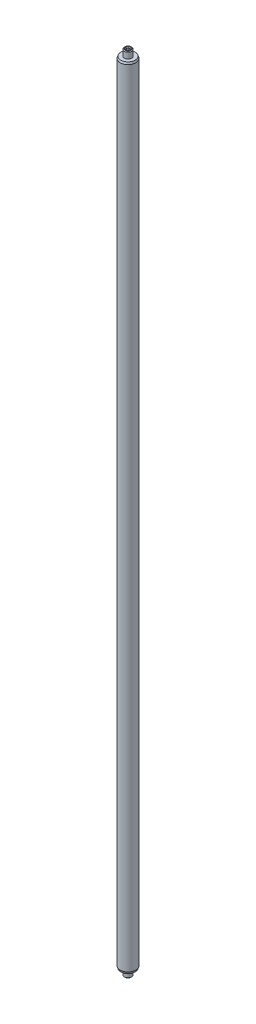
ISO-10303-21;
HEADER;
FILE_DESCRIPTION(('STEP AP214'),'2;1');
FILE_NAME('part.step','',(''),(''),'','','');
FILE_SCHEMA(('AUTOMOTIVE_DESIGN { 1 0 10303 214 1 1 1 1 }'));
ENDSEC;
DATA;
#1=APPLICATION_CONTEXT('core data for automotive mechanical design processes');
#2=APPLICATION_PROTOCOL_DEFINITION('international standard','automotive_design',2000,#1);
#3=PRODUCT_CONTEXT('',#1,'mechanical');
#4=PRODUCT('Part','Part','',(#3));
#5=PRODUCT_RELATED_PRODUCT_CATEGORY('part','',(#4));
#6=PRODUCT_DEFINITION_FORMATION('','',#4);
#7=PRODUCT_DEFINITION_CONTEXT('part definition',#1,'design');
#8=PRODUCT_DEFINITION('design','',#6,#7);
#9=PRODUCT_DEFINITION_SHAPE('','',#8);
#10=(LENGTH_UNIT() NAMED_UNIT(*) SI_UNIT(.MILLI.,.METRE.));
#11=(NAMED_UNIT(*) PLANE_ANGLE_UNIT() SI_UNIT($,.RADIAN.));
#12=(NAMED_UNIT(*) SI_UNIT($,.STERADIAN.) SOLID_ANGLE_UNIT());
#13=UNCERTAINTY_MEASURE_WITH_UNIT(LENGTH_MEASURE(1.E-05),#10,'distance_accuracy_value','');
#14=(GEOMETRIC_REPRESENTATION_CONTEXT(3) GLOBAL_UNCERTAINTY_ASSIGNED_CONTEXT((#13)) GLOBAL_UNIT_ASSIGNED_CONTEXT((#10,
#11,#12)) REPRESENTATION_CONTEXT('',''));
#15=CARTESIAN_POINT('',(0.,0.,0.));
#16=DIRECTION('',(0.,0.,1.));
#17=DIRECTION('',(1.,0.,0.));
#18=AXIS2_PLACEMENT_3D('',#15,#16,#17);
#19=CARTESIAN_POINT('',(-1.06592274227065,154.885936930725,-1.12643595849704));
#20=DIRECTION('',(0.,-1.,0.));
#21=DIRECTION('',(0.,0.,-1.));
#22=AXIS2_PLACEMENT_3D('',#19,#20,#21);
#23=PLANE('',#22);
#24=CARTESIAN_POINT('',(-1.06592274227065,154.885936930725,-1.12643595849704));
#25=DIRECTION('',(0.,-1.,0.));
#26=DIRECTION('',(0.,0.,-1.));
#27=AXIS2_PLACEMENT_3D('',#24,#25,#26);
#28=CIRCLE('',#27,1.3843);
#29=CARTESIAN_POINT('',(-1.06592274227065,154.885936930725,-2.51073595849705));
#30=VERTEX_POINT('',#29);
#31=EDGE_CURVE('P0_E11',#30,#30,#28,.T.);
#32=ORIENTED_EDGE('',*,*,#31,.T.);
#33=EDGE_LOOP('',(#32));
#34=FACE_BOUND('',#33,.T.);
#35=CARTESIAN_POINT('',(-1.06592274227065,154.885936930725,-1.12643595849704));
#36=DIRECTION('',(0.,1.,0.));
#37=DIRECTION('',(0.,0.,1.));
#38=AXIS2_PLACEMENT_3D('',#35,#36,#37);
#39=CIRCLE('',#38,2.74319999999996);
#40=CARTESIAN_POINT('',(-1.06592274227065,154.885936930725,1.61676404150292));
#41=VERTEX_POINT('',#40);
#42=EDGE_CURVE('P0_E62',#41,#41,#39,.T.);
#43=ORIENTED_EDGE('',*,*,#42,.T.);
#44=EDGE_LOOP('',(#43));
#45=FACE_BOUND('',#44,.T.);
#46=ADVANCED_FACE('P0_F16',(#34,#45),#23,.F.);
#47=CARTESIAN_POINT('',(-1.06592274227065,154.123936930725,-1.12643595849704));
#48=DIRECTION('',(0.,-1.,0.));
#49=DIRECTION('',(0.,0.,-1.));
#50=AXIS2_PLACEMENT_3D('',#47,#48,#49);
#51=CONICAL_SURFACE('',#50,2.9972,0.321750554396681);
#52=ORIENTED_EDGE('',*,*,#42,.F.);
#53=EDGE_LOOP('',(#52));
#54=FACE_BOUND('',#53,.T.);
#55=CARTESIAN_POINT('',(-1.06592274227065,154.123936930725,-1.12643595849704));
#56=DIRECTION('',(0.,1.,0.));
#57=DIRECTION('',(0.,0.,1.));
#58=AXIS2_PLACEMENT_3D('',#55,#56,#57);
#59=CIRCLE('',#58,2.9972);
#60=CARTESIAN_POINT('',(-1.06592274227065,154.123936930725,1.87076404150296));
#61=VERTEX_POINT('',#60);
#62=EDGE_CURVE('P0_E58',#61,#61,#59,.T.);
#63=ORIENTED_EDGE('',*,*,#62,.T.);
#64=EDGE_LOOP('',(#63));
#65=FACE_BOUND('',#64,.T.);
#66=ADVANCED_FACE('P0_F88',(#54,#65),#51,.T.);
#67=CARTESIAN_POINT('',(-1.06592274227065,154.885936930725,-1.12643595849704));
#68=DIRECTION('',(0.,1.,0.));
#69=DIRECTION('',(0.,0.,1.));
#70=AXIS2_PLACEMENT_3D('',#67,#68,#69);
#71=CYLINDRICAL_SURFACE('',#70,2.9972);
#72=ORIENTED_EDGE('',*,*,#62,.F.);
#73=EDGE_LOOP('',(#72));
#74=FACE_BOUND('',#73,.T.);
#75=CARTESIAN_POINT('',(-1.06592274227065,-149.152063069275,-1.12643595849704));
#76=DIRECTION('',(0.,1.,0.));
#77=DIRECTION('',(0.,0.,1.));
#78=AXIS2_PLACEMENT_3D('',#75,#76,#77);
#79=CIRCLE('',#78,2.9972);
#80=CARTESIAN_POINT('',(-1.06592274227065,-149.152063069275,1.87076404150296));
#81=VERTEX_POINT('',#80);
#82=EDGE_CURVE('P0_E54',#81,#81,#79,.T.);
#83=ORIENTED_EDGE('',*,*,#82,.T.);
#84=EDGE_LOOP('',(#83));
#85=FACE_BOUND('',#84,.T.);
#86=ADVANCED_FACE('P0_F94',(#74,#85),#71,.T.);
#87=CARTESIAN_POINT('',(-1.06592274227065,-149.914063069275,-1.12643595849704));
#88=DIRECTION('',(0.,1.,0.));
#89=DIRECTION('',(0.,0.,1.));
#90=AXIS2_PLACEMENT_3D('',#87,#88,#89);
#91=CONICAL_SURFACE('',#90,2.74319999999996,0.321750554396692);
#92=ORIENTED_EDGE('',*,*,#82,.F.);
#93=EDGE_LOOP('',(#92));
#94=FACE_BOUND('',#93,.T.);
#95=CARTESIAN_POINT('',(-1.06592274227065,-149.914063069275,-1.12643595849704));
#96=DIRECTION('',(0.,1.,0.));
#97=DIRECTION('',(0.,0.,1.));
#98=AXIS2_PLACEMENT_3D('',#95,#96,#97);
#99=CIRCLE('',#98,2.74319999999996);
#100=CARTESIAN_POINT('',(-1.06592274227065,-149.914063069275,1.61676404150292));
#101=VERTEX_POINT('',#100);
#102=EDGE_CURVE('P0_E48',#101,#101,#99,.T.);
#103=ORIENTED_EDGE('',*,*,#102,.T.);
#104=EDGE_LOOP('',(#103));
#105=FACE_BOUND('',#104,.T.);
#106=ADVANCED_FACE('P0_F101',(#94,#105),#91,.T.);
#107=CARTESIAN_POINT('',(1.67727725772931,-149.914063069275,-1.12643595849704));
#108=DIRECTION('',(0.,1.,0.));
#109=DIRECTION('',(0.,0.,1.));
#110=AXIS2_PLACEMENT_3D('',#107,#108,#109);
#111=PLANE('',#110);
#112=CARTESIAN_POINT('',(-1.06592274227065,-149.914063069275,-1.12643595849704));
#113=DIRECTION('',(0.,1.,0.));
#114=DIRECTION('',(0.,0.,1.));
#115=AXIS2_PLACEMENT_3D('',#112,#113,#114);
#116=CIRCLE('',#115,1.3843);
#117=CARTESIAN_POINT('',(-1.06592274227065,-149.914063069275,0.257864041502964));
#118=VERTEX_POINT('',#117);
#119=EDGE_CURVE('P0_E70',#118,#118,#116,.T.);
#120=ORIENTED_EDGE('',*,*,#119,.T.);
#121=EDGE_LOOP('',(#120));
#122=FACE_BOUND('',#121,.T.);
#123=ORIENTED_EDGE('',*,*,#102,.F.);
#124=EDGE_LOOP('',(#123));
#125=FACE_BOUND('',#124,.T.);
#126=ADVANCED_FACE('P0_F105',(#122,#125),#111,.F.);
#127=CARTESIAN_POINT('',(-1.06592274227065,-149.914063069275,-1.12643595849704));
#128=DIRECTION('',(0.,-1.,0.));
#129=DIRECTION('',(0.,0.,-1.));
#130=AXIS2_PLACEMENT_3D('',#127,#128,#129);
#131=CYLINDRICAL_SURFACE('',#130,1.1303);
#132=CARTESIAN_POINT('',(-1.06592274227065,-149.474122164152,-1.12643595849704));
#133=DIRECTION('',(0.,1.,0.));
#134=DIRECTION('',(0.,0.,1.));
#135=AXIS2_PLACEMENT_3D('',#132,#133,#134);
#136=CIRCLE('',#135,1.1303);
#137=CARTESIAN_POINT('',(-1.06592274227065,-149.474122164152,0.00386404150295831));
#138=VERTEX_POINT('',#137);
#139=EDGE_CURVE('P0_E66',#138,#138,#136,.F.);
#140=ORIENTED_EDGE('',*,*,#139,.T.);
#141=EDGE_LOOP('',(#140));
#142=FACE_BOUND('',#141,.T.);
#143=CARTESIAN_POINT('',(-1.06592274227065,-144.199063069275,-1.12643595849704));
#144=DIRECTION('',(0.,-1.,0.));
#145=DIRECTION('',(0.,0.,-1.));
#146=AXIS2_PLACEMENT_3D('',#143,#144,#145);
#147=CIRCLE('',#146,1.1303);
#148=CARTESIAN_POINT('',(-1.06592274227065,-144.199063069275,-2.25673595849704));
#149=VERTEX_POINT('',#148);
#150=EDGE_CURVE('P0_E42',#149,#149,#147,.T.);
#151=ORIENTED_EDGE('',*,*,#150,.F.);
#152=EDGE_LOOP('',(#151));
#153=FACE_BOUND('',#152,.T.);
#154=ADVANCED_FACE('P0_F109',(#142,#153),#131,.F.);
#155=CARTESIAN_POINT('',(-1.06592274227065,-144.199063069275,-1.12643595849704));
#156=DIRECTION('',(0.,-1.,0.));
#157=DIRECTION('',(0.,0.,-1.));
#158=AXIS2_PLACEMENT_3D('',#155,#156,#157);
#159=CONICAL_SURFACE('',#158,1.1303,1.02974425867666);
#160=CARTESIAN_POINT('',(-1.06592274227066,-143.519910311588,-1.12643595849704));
#161=VERTEX_POINT('',#160);
#162=VERTEX_LOOP('',#161);
#163=FACE_BOUND('',#162,.T.);
#164=ORIENTED_EDGE('',*,*,#150,.T.);
#165=EDGE_LOOP('',(#164));
#166=FACE_BOUND('',#165,.T.);
#167=ADVANCED_FACE('P0_F113',(#163,#166),#159,.F.);
#168=CARTESIAN_POINT('',(-1.06592274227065,154.885936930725,-1.12643595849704));
#169=DIRECTION('',(0.,1.,0.));
#170=DIRECTION('',(0.,0.,1.));
#171=AXIS2_PLACEMENT_3D('',#168,#169,#170);
#172=CYLINDRICAL_SURFACE('',#171,1.1303);
#173=CARTESIAN_POINT('',(-1.06592274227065,154.445996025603,-1.12643595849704));
#174=DIRECTION('',(0.,-1.,0.));
#175=DIRECTION('',(0.,0.,-1.));
#176=AXIS2_PLACEMENT_3D('',#173,#174,#175);
#177=CIRCLE('',#176,1.1303);
#178=CARTESIAN_POINT('',(-1.06592274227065,154.445996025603,-2.25673595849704));
#179=VERTEX_POINT('',#178);
#180=EDGE_CURVE('P0_E25',#179,#179,#177,.F.);
#181=ORIENTED_EDGE('',*,*,#180,.T.);
#182=EDGE_LOOP('',(#181));
#183=FACE_BOUND('',#182,.T.);
#184=CARTESIAN_POINT('',(-1.06592274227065,149.170936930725,-1.12643595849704));
#185=DIRECTION('',(0.,1.,0.));
#186=DIRECTION('',(0.,0.,1.));
#187=AXIS2_PLACEMENT_3D('',#184,#185,#186);
#188=CIRCLE('',#187,1.1303);
#189=CARTESIAN_POINT('',(-1.06592274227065,149.170936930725,0.00386404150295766));
#190=VERTEX_POINT('',#189);
#191=EDGE_CURVE('P0_E39',#190,#190,#188,.T.);
#192=ORIENTED_EDGE('',*,*,#191,.F.);
#193=EDGE_LOOP('',(#192));
#194=FACE_BOUND('',#193,.T.);
#195=ADVANCED_FACE('P0_F35',(#183,#194),#172,.F.);
#196=CARTESIAN_POINT('',(-1.06592274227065,149.170936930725,-1.12643595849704));
#197=DIRECTION('',(0.,1.,0.));
#198=DIRECTION('',(0.,0.,1.));
#199=AXIS2_PLACEMENT_3D('',#196,#197,#198);
#200=CONICAL_SURFACE('',#199,1.1303,1.02974425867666);
#201=CARTESIAN_POINT('',(-1.06592274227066,148.491784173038,-1.12643595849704));
#202=VERTEX_POINT('',#201);
#203=VERTEX_LOOP('',#202);
#204=FACE_BOUND('',#203,.T.);
#205=ORIENTED_EDGE('',*,*,#191,.T.);
#206=EDGE_LOOP('',(#205));
#207=FACE_BOUND('',#206,.T.);
#208=ADVANCED_FACE('P0_F31',(#204,#207),#200,.F.);
#209=CARTESIAN_POINT('',(-1.06592274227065,-149.474122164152,-1.12643595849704));
#210=DIRECTION('',(0.,-1.,0.));
#211=DIRECTION('',(0.,0.,-1.));
#212=AXIS2_PLACEMENT_3D('',#209,#210,#211);
#213=CONICAL_SURFACE('',#212,1.1303,0.523598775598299);
#214=ORIENTED_EDGE('',*,*,#119,.F.);
#215=EDGE_LOOP('',(#214));
#216=FACE_BOUND('',#215,.T.);
#217=ORIENTED_EDGE('',*,*,#139,.F.);
#218=EDGE_LOOP('',(#217));
#219=FACE_BOUND('',#218,.T.);
#220=ADVANCED_FACE('P0_F34',(#216,#219),#213,.F.);
#221=CARTESIAN_POINT('',(-1.06592274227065,154.445996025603,-1.12643595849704));
#222=DIRECTION('',(0.,1.,0.));
#223=DIRECTION('',(0.,0.,1.));
#224=AXIS2_PLACEMENT_3D('',#221,#222,#223);
#225=CONICAL_SURFACE('',#224,1.1303,0.523598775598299);
#226=ORIENTED_EDGE('',*,*,#31,.F.);
#227=EDGE_LOOP('',(#226));
#228=FACE_BOUND('',#227,.T.);
#229=ORIENTED_EDGE('',*,*,#180,.F.);
#230=EDGE_LOOP('',(#229));
#231=FACE_BOUND('',#230,.T.);
#232=ADVANCED_FACE('P0_F18',(#228,#231),#225,.F.);
#233=CLOSED_SHELL('',(#46,#66,#86,#106,#126,#154,#167,#195,#208,#220,#232));
#234=MANIFOLD_SOLID_BREP('P0_B1',#233);
#235=CARTESIAN_POINT('',(-1.64154912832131,151.075936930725,-2.42715730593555));
#236=DIRECTION('',(0.,1.,0.));
#237=DIRECTION('',(-0.914455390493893,0.,0.40468671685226));
#238=AXIS2_PLACEMENT_3D('',#235,#236,#237);
#239=PLANE('',#238);
#240=CARTESIAN_POINT('',(-1.06592274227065,151.075936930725,-1.12643595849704));
#241=DIRECTION('',(0.,1.,0.));
#242=DIRECTION('',(-0.914455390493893,0.,0.40468671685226));
#243=AXIS2_PLACEMENT_3D('',#240,#241,#242);
#244=CIRCLE('',#243,1.1684);
#245=CARTESIAN_POINT('',(-2.13437242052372,151.075936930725,-0.653599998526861));
#246=VERTEX_POINT('',#245);
#247=EDGE_CURVE('P1_E138',#246,#246,#244,.F.);
#248=ORIENTED_EDGE('',*,*,#247,.T.);
#249=EDGE_LOOP('',(#248));
#250=FACE_BOUND('',#249,.T.);
#251=ADVANCED_FACE('P1_F16',(#250),#239,.F.);
#252=CARTESIAN_POINT('',(-1.06592274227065,157.425936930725,-1.12643595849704));
#253=DIRECTION('',(0.,-1.,0.));
#254=DIRECTION('',(0.914455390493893,0.,-0.40468671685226));
#255=AXIS2_PLACEMENT_3D('',#252,#253,#254);
#256=PLANE('',#255);
#257=DIRECTION('',(-0.5895982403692,0.,0.807696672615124));
#258=VECTOR('',#257,1.);
#259=CARTESIAN_POINT('',(-0.347880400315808,157.425936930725,-0.602283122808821));
#260=LINE('',#259,#258);
#261=CARTESIAN_POINT('',(-0.0452606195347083,157.425936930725,-1.016845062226));
#262=VERTEX_POINT('',#261);
#263=CARTESIAN_POINT('',(-0.650500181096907,157.425936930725,-0.187721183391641));
#264=VERTEX_POINT('',#263);
#265=EDGE_CURVE('P1_E182',#262,#264,#260,.T.);
#266=ORIENTED_EDGE('',*,*,#265,.T.);
#267=DIRECTION('',(-0.99428495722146,0.,-0.106758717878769));
#268=VECTOR('',#267,1.);
#269=CARTESIAN_POINT('',(-1.16083124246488,157.425936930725,-0.242516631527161));
#270=LINE('',#269,#268);
#271=CARTESIAN_POINT('',(-1.67116230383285,157.425936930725,-0.297312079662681));
#272=VERTEX_POINT('',#271);
#273=EDGE_CURVE('P1_E185',#264,#272,#270,.T.);
#274=ORIENTED_EDGE('',*,*,#273,.T.);
#275=DIRECTION('',(-0.40468671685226,0.,-0.914455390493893));
#276=VECTOR('',#275,1.);
#277=CARTESIAN_POINT('',(-1.87887358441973,157.425936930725,-0.766669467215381));
#278=LINE('',#277,#276);
#279=CARTESIAN_POINT('',(-2.0865848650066,157.425936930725,-1.23602685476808));
#280=VERTEX_POINT('',#279);
#281=EDGE_CURVE('P1_E170',#272,#280,#278,.T.);
#282=ORIENTED_EDGE('',*,*,#281,.T.);
#283=DIRECTION('',(0.5895982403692,0.,-0.807696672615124));
#284=VECTOR('',#283,1.);
#285=CARTESIAN_POINT('',(-1.7839650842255,157.425936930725,-1.65058879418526));
#286=LINE('',#285,#284);
#287=CARTESIAN_POINT('',(-1.4813453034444,157.425936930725,-2.06515073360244));
#288=VERTEX_POINT('',#287);
#289=EDGE_CURVE('P1_E173',#280,#288,#286,.T.);
#290=ORIENTED_EDGE('',*,*,#289,.T.);
#291=DIRECTION('',(0.994284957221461,0.,0.106758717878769));
#292=VECTOR('',#291,1.);
#293=CARTESIAN_POINT('',(-0.971014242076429,157.425936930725,-2.01035528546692));
#294=LINE('',#293,#292);
#295=CARTESIAN_POINT('',(-0.460683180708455,157.425936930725,-1.9555598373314));
#296=VERTEX_POINT('',#295);
#297=EDGE_CURVE('P1_E176',#288,#296,#294,.T.);
#298=ORIENTED_EDGE('',*,*,#297,.T.);
#299=DIRECTION('',(0.40468671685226,0.,0.914455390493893));
#300=VECTOR('',#299,1.);
#301=CARTESIAN_POINT('',(-0.252971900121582,157.425936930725,-1.4862024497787));
#302=LINE('',#301,#300);
#303=EDGE_CURVE('P1_E179',#296,#262,#302,.T.);
#304=ORIENTED_EDGE('',*,*,#303,.T.);
#305=EDGE_LOOP('',(#266,#274,#282,#290,#298,#304));
#306=FACE_BOUND('',#305,.T.);
#307=CARTESIAN_POINT('',(-1.06592274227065,157.425936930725,-1.12643595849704));
#308=DIRECTION('',(0.,-1.,0.));
#309=DIRECTION('',(0.914455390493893,0.,-0.40468671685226));
#310=AXIS2_PLACEMENT_3D('',#307,#308,#309);
#311=CIRCLE('',#310,1.1684);
#312=CARTESIAN_POINT('',(0.00252693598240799,157.425936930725,-1.59927191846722));
#313=VERTEX_POINT('',#312);
#314=EDGE_CURVE('P1_E162',#313,#313,#311,.F.);
#315=ORIENTED_EDGE('',*,*,#314,.T.);
#316=EDGE_LOOP('',(#315));
#317=FACE_BOUND('',#316,.T.);
#318=ADVANCED_FACE('P1_F273',(#306,#317),#256,.F.);
#319=CARTESIAN_POINT('',(-1.06592274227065,151.075936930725,-1.12643595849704));
#320=DIRECTION('',(0.,-1.,0.));
#321=DIRECTION('',(0.914455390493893,0.,-0.40468671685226));
#322=AXIS2_PLACEMENT_3D('',#319,#320,#321);
#323=CYLINDRICAL_SURFACE('',#322,1.4224);
#324=CARTESIAN_POINT('',(-1.06592274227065,151.329936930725,-1.12643595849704));
#325=DIRECTION('',(0.,1.,0.));
#326=DIRECTION('',(-0.914455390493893,0.,0.40468671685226));
#327=AXIS2_PLACEMENT_3D('',#324,#325,#326);
#328=CIRCLE('',#327,1.4224);
#329=CARTESIAN_POINT('',(-2.36664408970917,151.329936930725,-0.550809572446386));
#330=VERTEX_POINT('',#329);
#331=EDGE_CURVE('P1_E158',#330,#330,#328,.T.);
#332=ORIENTED_EDGE('',*,*,#331,.T.);
#333=EDGE_LOOP('',(#332));
#334=FACE_BOUND('',#333,.T.);
#335=CARTESIAN_POINT('',(-1.06592274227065,157.171936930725,-1.12643595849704));
#336=DIRECTION('',(0.,-1.,0.));
#337=DIRECTION('',(0.914455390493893,0.,-0.40468671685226));
#338=AXIS2_PLACEMENT_3D('',#335,#336,#337);
#339=CIRCLE('',#338,1.4224);
#340=CARTESIAN_POINT('',(0.234798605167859,157.171936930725,-1.7020623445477));
#341=VERTEX_POINT('',#340);
#342=EDGE_CURVE('P1_E154',#341,#341,#339,.T.);
#343=ORIENTED_EDGE('',*,*,#342,.T.);
#344=EDGE_LOOP('',(#343));
#345=FACE_BOUND('',#344,.T.);
#346=ADVANCED_FACE('P1_F290',(#334,#345),#323,.T.);
#347=CARTESIAN_POINT('',(-1.06592274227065,151.075936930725,-1.12643595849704));
#348=DIRECTION('',(0.,1.,0.));
#349=DIRECTION('',(-0.914455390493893,0.,0.40468671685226));
#350=AXIS2_PLACEMENT_3D('',#347,#348,#349);
#351=CONICAL_SURFACE('',#350,1.1684,0.785398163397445);
#352=ORIENTED_EDGE('',*,*,#331,.F.);
#353=EDGE_LOOP('',(#352));
#354=FACE_BOUND('',#353,.T.);
#355=ORIENTED_EDGE('',*,*,#247,.F.);
#356=EDGE_LOOP('',(#355));
#357=FACE_BOUND('',#356,.T.);
#358=ADVANCED_FACE('P1_F293',(#354,#357),#351,.T.);
#359=CARTESIAN_POINT('',(-1.06592274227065,157.171936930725,-1.12643595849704));
#360=DIRECTION('',(0.,-1.,0.));
#361=DIRECTION('',(0.914455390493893,0.,-0.40468671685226));
#362=AXIS2_PLACEMENT_3D('',#359,#360,#361);
#363=CONICAL_SURFACE('',#362,1.4224,0.78539816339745);
#364=ORIENTED_EDGE('',*,*,#314,.F.);
#365=EDGE_LOOP('',(#364));
#366=FACE_BOUND('',#365,.T.);
#367=ORIENTED_EDGE('',*,*,#342,.F.);
#368=EDGE_LOOP('',(#367));
#369=FACE_BOUND('',#368,.T.);
#370=ADVANCED_FACE('P1_F295',(#366,#369),#363,.T.);
#371=CARTESIAN_POINT('',(-0.769192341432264,156.155936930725,-0.455925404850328));
#372=DIRECTION('',(0.807696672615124,0.,0.5895982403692));
#373=DIRECTION('',(0.5895982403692,0.,-0.807696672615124));
#374=AXIS2_PLACEMENT_3D('',#371,#372,#373);
#375=PLANE('',#374);
#376=DIRECTION('',(0.,1.,0.));
#377=VECTOR('',#376,1.);
#378=CARTESIAN_POINT('',(-0.769192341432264,156.155936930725,-0.455925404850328));
#379=LINE('',#378,#377);
#380=CARTESIAN_POINT('',(-0.769192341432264,156.155936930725,-0.455925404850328));
#381=VERTEX_POINT('',#380);
#382=CARTESIAN_POINT('',(-0.769192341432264,157.171936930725,-0.455925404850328));
#383=VERTEX_POINT('',#382);
#384=EDGE_CURVE('P1_E135',#381,#383,#379,.T.);
#385=ORIENTED_EDGE('',*,*,#384,.T.);
#386=DIRECTION('',(0.5895982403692,0.,-0.807696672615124));
#387=VECTOR('',#386,1.);
#388=CARTESIAN_POINT('',(-0.769192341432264,157.171936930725,-0.455925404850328));
#389=LINE('',#388,#387);
#390=CARTESIAN_POINT('',(-0.336878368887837,157.171936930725,-1.04815674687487));
#391=VERTEX_POINT('',#390);
#392=EDGE_CURVE('P1_E94',#383,#391,#389,.T.);
#393=ORIENTED_EDGE('',*,*,#392,.T.);
#394=DIRECTION('',(0.,1.,0.));
#395=VECTOR('',#394,1.);
#396=CARTESIAN_POINT('',(-0.336878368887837,156.155936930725,-1.04815674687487));
#397=LINE('',#396,#395);
#398=CARTESIAN_POINT('',(-0.336878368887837,156.155936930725,-1.04815674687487));
#399=VERTEX_POINT('',#398);
#400=EDGE_CURVE('P1_E86',#399,#391,#397,.T.);
#401=ORIENTED_EDGE('',*,*,#400,.F.);
#402=DIRECTION('',(0.5895982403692,0.,-0.807696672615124));
#403=VECTOR('',#402,1.);
#404=CARTESIAN_POINT('',(-0.769192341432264,156.155936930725,-0.455925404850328));
#405=LINE('',#404,#403);
#406=EDGE_CURVE('P1_E91',#381,#399,#405,.T.);
#407=ORIENTED_EDGE('',*,*,#406,.F.);
#408=EDGE_LOOP('',(#385,#393,#401,#407));
#409=FACE_BOUND('',#408,.T.);
#410=ADVANCED_FACE('P1_F89',(#409),#375,.F.);
#411=CARTESIAN_POINT('',(-1.49823671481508,156.155936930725,-0.534204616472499));
#412=DIRECTION('',(-0.106758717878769,0.,0.99428495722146));
#413=DIRECTION('',(0.99428495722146,0.,0.106758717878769));
#414=AXIS2_PLACEMENT_3D('',#411,#412,#413);
#415=PLANE('',#414);
#416=DIRECTION('',(0.,1.,0.));
#417=VECTOR('',#416,1.);
#418=CARTESIAN_POINT('',(-1.49823671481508,156.155936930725,-0.534204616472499));
#419=LINE('',#418,#417);
#420=CARTESIAN_POINT('',(-1.49823671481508,156.155936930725,-0.534204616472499));
#421=VERTEX_POINT('',#420);
#422=CARTESIAN_POINT('',(-1.49823671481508,157.171936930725,-0.534204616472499));
#423=VERTEX_POINT('',#422);
#424=EDGE_CURVE('P1_E139',#421,#423,#419,.T.);
#425=ORIENTED_EDGE('',*,*,#424,.T.);
#426=DIRECTION('',(0.99428495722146,0.,0.106758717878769));
#427=VECTOR('',#426,1.);
#428=CARTESIAN_POINT('',(-1.49823671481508,157.171936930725,-0.534204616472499));
#429=LINE('',#428,#427);
#430=EDGE_CURVE('P1_E166',#423,#383,#429,.T.);
#431=ORIENTED_EDGE('',*,*,#430,.T.);
#432=ORIENTED_EDGE('',*,*,#384,.F.);
#433=DIRECTION('',(0.99428495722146,0.,0.106758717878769));
#434=VECTOR('',#433,1.);
#435=CARTESIAN_POINT('',(-1.49823671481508,156.155936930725,-0.534204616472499));
#436=LINE('',#435,#434);
#437=EDGE_CURVE('P1_E99',#421,#381,#436,.T.);
#438=ORIENTED_EDGE('',*,*,#437,.F.);
#439=EDGE_LOOP('',(#425,#431,#432,#438));
#440=FACE_BOUND('',#439,.T.);
#441=ADVANCED_FACE('P1_F262',(#440),#415,.F.);
#442=CARTESIAN_POINT('',(-1.79496711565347,156.155936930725,-1.20471517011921));
#443=DIRECTION('',(-0.914455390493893,0.,0.40468671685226));
#444=DIRECTION('',(0.40468671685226,0.,0.914455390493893));
#445=AXIS2_PLACEMENT_3D('',#442,#443,#444);
#446=PLANE('',#445);
#447=DIRECTION('',(0.,1.,0.));
#448=VECTOR('',#447,1.);
#449=CARTESIAN_POINT('',(-1.79496711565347,156.155936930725,-1.20471517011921));
#450=LINE('',#449,#448);
#451=CARTESIAN_POINT('',(-1.79496711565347,156.155936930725,-1.20471517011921));
#452=VERTEX_POINT('',#451);
#453=CARTESIAN_POINT('',(-1.79496711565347,157.171936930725,-1.20471517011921));
#454=VERTEX_POINT('',#453);
#455=EDGE_CURVE('P1_E143',#452,#454,#450,.T.);
#456=ORIENTED_EDGE('',*,*,#455,.T.);
#457=DIRECTION('',(0.40468671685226,0.,0.914455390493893));
#458=VECTOR('',#457,1.);
#459=CARTESIAN_POINT('',(-1.79496711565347,157.171936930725,-1.20471517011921));
#460=LINE('',#459,#458);
#461=EDGE_CURVE('P1_E11',#454,#423,#460,.T.);
#462=ORIENTED_EDGE('',*,*,#461,.T.);
#463=ORIENTED_EDGE('',*,*,#424,.F.);
#464=DIRECTION('',(0.40468671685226,0.,0.914455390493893));
#465=VECTOR('',#464,1.);
#466=CARTESIAN_POINT('',(-1.79496711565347,156.155936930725,-1.20471517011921));
#467=LINE('',#466,#465);
#468=EDGE_CURVE('P1_E130',#452,#421,#467,.T.);
#469=ORIENTED_EDGE('',*,*,#468,.F.);
#470=EDGE_LOOP('',(#456,#462,#463,#469));
#471=FACE_BOUND('',#470,.T.);
#472=ADVANCED_FACE('P1_F317',(#471),#446,.F.);
#473=CARTESIAN_POINT('',(-1.36265314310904,156.155936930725,-1.79694651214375));
#474=DIRECTION('',(-0.807696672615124,0.,-0.5895982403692));
#475=DIRECTION('',(-0.5895982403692,0.,0.807696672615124));
#476=AXIS2_PLACEMENT_3D('',#473,#474,#475);
#477=PLANE('',#476);
#478=DIRECTION('',(0.,1.,0.));
#479=VECTOR('',#478,1.);
#480=CARTESIAN_POINT('',(-1.36265314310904,156.155936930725,-1.79694651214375));
#481=LINE('',#480,#479);
#482=CARTESIAN_POINT('',(-1.36265314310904,156.155936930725,-1.79694651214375));
#483=VERTEX_POINT('',#482);
#484=CARTESIAN_POINT('',(-1.36265314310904,157.171936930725,-1.79694651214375));
#485=VERTEX_POINT('',#484);
#486=EDGE_CURVE('P1_E146',#483,#485,#481,.T.);
#487=ORIENTED_EDGE('',*,*,#486,.T.);
#488=DIRECTION('',(-0.5895982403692,0.,0.807696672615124));
#489=VECTOR('',#488,1.);
#490=CARTESIAN_POINT('',(-1.36265314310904,157.171936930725,-1.79694651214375));
#491=LINE('',#490,#489);
#492=EDGE_CURVE('P1_E24',#485,#454,#491,.T.);
#493=ORIENTED_EDGE('',*,*,#492,.T.);
#494=ORIENTED_EDGE('',*,*,#455,.F.);
#495=DIRECTION('',(-0.5895982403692,0.,0.807696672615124));
#496=VECTOR('',#495,1.);
#497=CARTESIAN_POINT('',(-1.36265314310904,156.155936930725,-1.79694651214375));
#498=LINE('',#497,#496);
#499=EDGE_CURVE('P1_E126',#483,#452,#498,.T.);
#500=ORIENTED_EDGE('',*,*,#499,.F.);
#501=EDGE_LOOP('',(#487,#493,#494,#500));
#502=FACE_BOUND('',#501,.T.);
#503=ADVANCED_FACE('P1_F314',(#502),#477,.F.);
#504=CARTESIAN_POINT('',(-0.633608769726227,156.155936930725,-1.71866730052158));
#505=DIRECTION('',(0.106758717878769,0.,-0.99428495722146));
#506=DIRECTION('',(-0.994284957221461,0.,-0.106758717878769));
#507=AXIS2_PLACEMENT_3D('',#504,#505,#506);
#508=PLANE('',#507);
#509=DIRECTION('',(0.,1.,0.));
#510=VECTOR('',#509,1.);
#511=CARTESIAN_POINT('',(-0.633608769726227,156.155936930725,-1.71866730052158));
#512=LINE('',#511,#510);
#513=CARTESIAN_POINT('',(-0.633608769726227,156.155936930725,-1.71866730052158));
#514=VERTEX_POINT('',#513);
#515=CARTESIAN_POINT('',(-0.633608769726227,157.171936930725,-1.71866730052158));
#516=VERTEX_POINT('',#515);
#517=EDGE_CURVE('P1_E98',#514,#516,#512,.T.);
#518=ORIENTED_EDGE('',*,*,#517,.T.);
#519=DIRECTION('',(-0.994284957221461,0.,-0.106758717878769));
#520=VECTOR('',#519,1.);
#521=CARTESIAN_POINT('',(-0.633608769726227,157.171936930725,-1.71866730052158));
#522=LINE('',#521,#520);
#523=EDGE_CURVE('P1_E38',#516,#485,#522,.T.);
#524=ORIENTED_EDGE('',*,*,#523,.T.);
#525=ORIENTED_EDGE('',*,*,#486,.F.);
#526=DIRECTION('',(-0.99428495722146,0.,-0.106758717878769));
#527=VECTOR('',#526,1.);
#528=CARTESIAN_POINT('',(-0.633608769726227,156.155936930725,-1.71866730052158));
#529=LINE('',#528,#527);
#530=EDGE_CURVE('P1_E108',#514,#483,#529,.T.);
#531=ORIENTED_EDGE('',*,*,#530,.F.);
#532=EDGE_LOOP('',(#518,#524,#525,#531));
#533=FACE_BOUND('',#532,.T.);
#534=ADVANCED_FACE('P1_F229',(#533),#508,.F.);
#535=CARTESIAN_POINT('',(-0.336878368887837,156.155936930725,-1.04815674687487));
#536=DIRECTION('',(0.914455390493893,0.,-0.40468671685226));
#537=DIRECTION('',(-0.40468671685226,0.,-0.914455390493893));
#538=AXIS2_PLACEMENT_3D('',#535,#536,#537);
#539=PLANE('',#538);
#540=ORIENTED_EDGE('',*,*,#400,.T.);
#541=DIRECTION('',(-0.40468671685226,0.,-0.914455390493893));
#542=VECTOR('',#541,1.);
#543=CARTESIAN_POINT('',(-0.336878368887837,157.171936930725,-1.04815674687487));
#544=LINE('',#543,#542);
#545=EDGE_CURVE('P1_E191',#391,#516,#544,.T.);
#546=ORIENTED_EDGE('',*,*,#545,.T.);
#547=ORIENTED_EDGE('',*,*,#517,.F.);
#548=DIRECTION('',(-0.40468671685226,0.,-0.914455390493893));
#549=VECTOR('',#548,1.);
#550=CARTESIAN_POINT('',(-0.336878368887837,156.155936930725,-1.04815674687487));
#551=LINE('',#550,#549);
#552=EDGE_CURVE('P1_E102',#399,#514,#551,.T.);
#553=ORIENTED_EDGE('',*,*,#552,.F.);
#554=EDGE_LOOP('',(#540,#546,#547,#553));
#555=FACE_BOUND('',#554,.T.);
#556=ADVANCED_FACE('P1_F103',(#555),#539,.F.);
#557=CARTESIAN_POINT('',(-1.20150631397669,156.155936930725,0.136305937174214));
#558=DIRECTION('',(0.,-1.,0.));
#559=DIRECTION('',(0.914455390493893,0.,-0.40468671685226));
#560=AXIS2_PLACEMENT_3D('',#557,#558,#559);
#561=PLANE('',#560);
#562=ORIENTED_EDGE('',*,*,#406,.T.);
#563=ORIENTED_EDGE('',*,*,#552,.T.);
#564=ORIENTED_EDGE('',*,*,#530,.T.);
#565=ORIENTED_EDGE('',*,*,#499,.T.);
#566=ORIENTED_EDGE('',*,*,#468,.T.);
#567=ORIENTED_EDGE('',*,*,#437,.T.);
#568=EDGE_LOOP('',(#562,#563,#564,#565,#566,#567));
#569=FACE_BOUND('',#568,.T.);
#570=ADVANCED_FACE('P1_F110',(#569),#561,.F.);
#571=CARTESIAN_POINT('',(-0.633608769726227,157.171936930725,-1.71866730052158));
#572=DIRECTION('',(0.0754898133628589,-0.707106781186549,-0.703065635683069));
#573=DIRECTION('',(0.305914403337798,-0.654653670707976,0.691263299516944));
#574=AXIS2_PLACEMENT_3D('',#571,#572,#573);
#575=PLANE('',#574);
#576=DIRECTION('',(0.445694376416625,0.654653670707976,-0.610561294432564));
#577=VECTOR('',#576,1.);
#578=CARTESIAN_POINT('',(-0.757127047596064,156.990508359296,-1.54945834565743));
#579=LINE('',#578,#577);
#580=EDGE_CURVE('P1_E120',#296,#516,#579,.F.);
#581=ORIENTED_EDGE('',*,*,#580,.F.);
#582=ORIENTED_EDGE('',*,*,#297,.F.);
#583=DIRECTION('',(-0.305914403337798,0.654653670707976,-0.691263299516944));
#584=VECTOR('',#583,1.);
#585=CARTESIAN_POINT('',(-1.27787302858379,156.990508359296,-1.60537206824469));
#586=LINE('',#585,#584);
#587=EDGE_CURVE('P1_E114',#485,#288,#586,.T.);
#588=ORIENTED_EDGE('',*,*,#587,.F.);
#589=ORIENTED_EDGE('',*,*,#523,.F.);
#590=EDGE_LOOP('',(#581,#582,#588,#589));
#591=FACE_BOUND('',#590,.T.);
#592=ADVANCED_FACE('P1_F233',(#591),#575,.F.);
#593=CARTESIAN_POINT('',(-1.36265314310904,157.171936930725,-1.79694651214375));
#594=DIRECTION('',(-0.571127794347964,-0.707106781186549,-0.416908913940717));
#595=DIRECTION('',(0.305914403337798,-0.654653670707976,0.691263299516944));
#596=AXIS2_PLACEMENT_3D('',#593,#594,#595);
#597=PLANE('',#596);
#598=ORIENTED_EDGE('',*,*,#587,.T.);
#599=ORIENTED_EDGE('',*,*,#289,.F.);
#600=DIRECTION('',(-0.751608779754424,0.654653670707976,-0.08070200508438));
#601=VECTOR('',#600,1.);
#602=CARTESIAN_POINT('',(-1.58666872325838,156.990508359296,-1.18234968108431));
#603=LINE('',#602,#601);
#604=EDGE_CURVE('P1_E238',#454,#280,#603,.T.);
#605=ORIENTED_EDGE('',*,*,#604,.F.);
#606=ORIENTED_EDGE('',*,*,#492,.F.);
#607=EDGE_LOOP('',(#598,#599,#605,#606));
#608=FACE_BOUND('',#607,.T.);
#609=ADVANCED_FACE('P1_F276',(#608),#597,.F.);
#610=CARTESIAN_POINT('',(-0.336878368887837,157.171936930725,-1.04815674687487));
#611=DIRECTION('',(0.646617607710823,-0.707106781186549,-0.286156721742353));
#612=DIRECTION('',(0.646617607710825,0.707106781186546,-0.286156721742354));
#613=AXIS2_PLACEMENT_3D('',#610,#611,#612);
#614=PLANE('',#613);
#615=ORIENTED_EDGE('',*,*,#580,.T.);
#616=ORIENTED_EDGE('',*,*,#545,.F.);
#617=DIRECTION('',(0.751608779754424,0.654653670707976,0.0807020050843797));
#618=VECTOR('',#617,1.);
#619=CARTESIAN_POINT('',(-0.545176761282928,156.990508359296,-1.07052223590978));
#620=LINE('',#619,#618);
#621=EDGE_CURVE('P1_E242',#262,#391,#620,.F.);
#622=ORIENTED_EDGE('',*,*,#621,.F.);
#623=ORIENTED_EDGE('',*,*,#303,.F.);
#624=EDGE_LOOP('',(#615,#616,#622,#623));
#625=FACE_BOUND('',#624,.T.);
#626=ADVANCED_FACE('P1_F236',(#625),#614,.F.);
#627=CARTESIAN_POINT('',(-1.79496711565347,157.171936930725,-1.20471517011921));
#628=DIRECTION('',(-0.646617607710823,-0.707106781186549,0.286156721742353));
#629=DIRECTION('',(0.646617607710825,-0.707106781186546,-0.286156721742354));
#630=AXIS2_PLACEMENT_3D('',#627,#628,#629);
#631=PLANE('',#630);
#632=ORIENTED_EDGE('',*,*,#604,.T.);
#633=ORIENTED_EDGE('',*,*,#281,.F.);
#634=DIRECTION('',(0.445694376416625,-0.654653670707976,-0.610561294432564));
#635=VECTOR('',#634,1.);
#636=CARTESIAN_POINT('',(-1.49823671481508,157.171936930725,-0.534204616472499));
#637=LINE('',#636,#635);
#638=EDGE_CURVE('P1_E247',#423,#272,#637,.F.);
#639=ORIENTED_EDGE('',*,*,#638,.F.);
#640=ORIENTED_EDGE('',*,*,#461,.F.);
#641=EDGE_LOOP('',(#632,#633,#639,#640));
#642=FACE_BOUND('',#641,.T.);
#643=ADVANCED_FACE('P1_F269',(#642),#631,.F.);
#644=CARTESIAN_POINT('',(-0.769192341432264,157.171936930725,-0.455925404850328));
#645=DIRECTION('',(0.571127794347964,-0.707106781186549,0.416908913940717));
#646=DIRECTION('',(0.305914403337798,0.654653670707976,0.691263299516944));
#647=AXIS2_PLACEMENT_3D('',#644,#645,#646);
#648=PLANE('',#647);
#649=ORIENTED_EDGE('',*,*,#621,.T.);
#650=ORIENTED_EDGE('',*,*,#392,.F.);
#651=DIRECTION('',(0.305914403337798,0.654653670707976,0.691263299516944));
#652=VECTOR('',#651,1.);
#653=CARTESIAN_POINT('',(-0.853972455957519,156.990508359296,-0.647499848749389));
#654=LINE('',#653,#652);
#655=EDGE_CURVE('P1_E250',#264,#383,#654,.F.);
#656=ORIENTED_EDGE('',*,*,#655,.F.);
#657=ORIENTED_EDGE('',*,*,#265,.F.);
#658=EDGE_LOOP('',(#649,#650,#656,#657));
#659=FACE_BOUND('',#658,.T.);
#660=ADVANCED_FACE('P1_F260',(#659),#648,.F.);
#661=CARTESIAN_POINT('',(-1.49823671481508,157.171936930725,-0.534204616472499));
#662=DIRECTION('',(-0.0754898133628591,-0.707106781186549,0.70306563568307));
#663=DIRECTION('',(0.305914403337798,0.654653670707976,0.691263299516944));
#664=AXIS2_PLACEMENT_3D('',#661,#662,#663);
#665=PLANE('',#664);
#666=ORIENTED_EDGE('',*,*,#638,.T.);
#667=ORIENTED_EDGE('',*,*,#273,.F.);
#668=ORIENTED_EDGE('',*,*,#655,.T.);
#669=ORIENTED_EDGE('',*,*,#430,.F.);
#670=EDGE_LOOP('',(#666,#667,#668,#669));
#671=FACE_BOUND('',#670,.T.);
#672=ADVANCED_FACE('P1_F257',(#671),#665,.F.);
#673=CLOSED_SHELL('',(#251,#318,#346,#358,#370,#410,#441,#472,#503,#534,#556,#570,#592,#609,
#626,#643,#660,#672));
#674=MANIFOLD_SOLID_BREP('P1_B1',#673);
#675=CARTESIAN_POINT('',(0.124866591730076,-146.104063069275,-0.348462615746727));
#676=DIRECTION('',(0.,-1.,0.));
#677=DIRECTION('',(-0.546944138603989,0.,0.837169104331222));
#678=AXIS2_PLACEMENT_3D('',#675,#676,#677);
#679=PLANE('',#678);
#680=CARTESIAN_POINT('',(-1.06592274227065,-146.104063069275,-1.12643595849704));
#681=DIRECTION('',(0.,-1.,0.));
#682=DIRECTION('',(-0.546944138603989,0.,0.837169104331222));
#683=AXIS2_PLACEMENT_3D('',#680,#681,#682);
#684=CIRCLE('',#683,1.1684);
#685=CARTESIAN_POINT('',(-1.70497227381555,-146.104063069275,-0.148287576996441));
#686=VERTEX_POINT('',#685);
#687=EDGE_CURVE('P2_E138',#686,#686,#684,.F.);
#688=ORIENTED_EDGE('',*,*,#687,.T.);
#689=EDGE_LOOP('',(#688));
#690=FACE_BOUND('',#689,.T.);
#691=ADVANCED_FACE('P2_F16',(#690),#679,.F.);
#692=CARTESIAN_POINT('',(-1.06592274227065,-152.454063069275,-1.12643595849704));
#693=DIRECTION('',(0.,1.,0.));
#694=DIRECTION('',(0.546944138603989,0.,-0.837169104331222));
#695=AXIS2_PLACEMENT_3D('',#692,#693,#694);
#696=PLANE('',#695);
#697=DIRECTION('',(-0.892252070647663,0.,0.451537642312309));
#698=VECTOR('',#697,1.);
#699=CARTESIAN_POINT('',(-1.4673397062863,-152.454063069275,-1.91964804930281));
#700=LINE('',#699,#698);
#701=CARTESIAN_POINT('',(-1.00937849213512,-152.454063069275,-2.15140624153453));
#702=VERTEX_POINT('',#701);
#703=CARTESIAN_POINT('',(-1.92530092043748,-152.454063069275,-1.6878898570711));
#704=VERTEX_POINT('',#703);
#705=EDGE_CURVE('P2_E182',#702,#704,#700,.T.);
#706=ORIENTED_EDGE('',*,*,#705,.T.);
#707=DIRECTION('',(-0.0550829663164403,0.,0.998481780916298));
#708=VECTOR('',#707,1.);
#709=CARTESIAN_POINT('',(-1.95357304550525,-152.454063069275,-1.17540471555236));
#710=LINE('',#709,#708);
#711=CARTESIAN_POINT('',(-1.98184517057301,-152.454063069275,-0.662919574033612));
#712=VERTEX_POINT('',#711);
#713=EDGE_CURVE('P2_E185',#704,#712,#710,.T.);
#714=ORIENTED_EDGE('',*,*,#713,.T.);
#715=DIRECTION('',(0.837169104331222,0.,0.546944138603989));
#716=VECTOR('',#715,1.);
#717=CARTESIAN_POINT('',(-1.5521560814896,-152.454063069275,-0.382192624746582));
#718=LINE('',#717,#716);
#719=CARTESIAN_POINT('',(-1.12246699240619,-152.454063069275,-0.101465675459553));
#720=VERTEX_POINT('',#719);
#721=EDGE_CURVE('P2_E170',#712,#720,#718,.T.);
#722=ORIENTED_EDGE('',*,*,#721,.T.);
#723=DIRECTION('',(0.892252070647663,0.,-0.451537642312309));
#724=VECTOR('',#723,1.);
#725=CARTESIAN_POINT('',(-0.664505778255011,-152.454063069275,-0.333223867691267));
#726=LINE('',#725,#724);
#727=CARTESIAN_POINT('',(-0.206544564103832,-152.454063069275,-0.564982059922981));
#728=VERTEX_POINT('',#727);
#729=EDGE_CURVE('P2_E173',#720,#728,#726,.T.);
#730=ORIENTED_EDGE('',*,*,#729,.T.);
#731=DIRECTION('',(0.0550829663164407,0.,-0.998481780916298));
#732=VECTOR('',#731,1.);
#733=CARTESIAN_POINT('',(-0.178272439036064,-152.454063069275,-1.07746720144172));
#734=LINE('',#733,#732);
#735=CARTESIAN_POINT('',(-0.150000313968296,-152.454063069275,-1.58995234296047));
#736=VERTEX_POINT('',#735);
#737=EDGE_CURVE('P2_E176',#728,#736,#734,.T.);
#738=ORIENTED_EDGE('',*,*,#737,.T.);
#739=DIRECTION('',(-0.837169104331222,0.,-0.546944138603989));
#740=VECTOR('',#739,1.);
#741=CARTESIAN_POINT('',(-0.579689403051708,-152.454063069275,-1.8706792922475));
#742=LINE('',#741,#740);
#743=EDGE_CURVE('P2_E179',#736,#702,#742,.T.);
#744=ORIENTED_EDGE('',*,*,#743,.T.);
#745=EDGE_LOOP('',(#706,#714,#722,#730,#738,#744));
#746=FACE_BOUND('',#745,.T.);
#747=CARTESIAN_POINT('',(-1.06592274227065,-152.454063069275,-1.12643595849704));
#748=DIRECTION('',(0.,1.,0.));
#749=DIRECTION('',(0.546944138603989,0.,-0.837169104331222));
#750=AXIS2_PLACEMENT_3D('',#747,#748,#749);
#751=CIRCLE('',#750,1.1684);
#752=CARTESIAN_POINT('',(-0.426873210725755,-152.454063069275,-2.10458433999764));
#753=VERTEX_POINT('',#752);
#754=EDGE_CURVE('P2_E162',#753,#753,#751,.F.);
#755=ORIENTED_EDGE('',*,*,#754,.T.);
#756=EDGE_LOOP('',(#755));
#757=FACE_BOUND('',#756,.T.);
#758=ADVANCED_FACE('P2_F273',(#746,#757),#696,.F.);
#759=CARTESIAN_POINT('',(-1.06592274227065,-146.104063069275,-1.12643595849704));
#760=DIRECTION('',(0.,1.,0.));
#761=DIRECTION('',(0.546944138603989,0.,-0.837169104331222));
#762=AXIS2_PLACEMENT_3D('',#759,#760,#761);
#763=CYLINDRICAL_SURFACE('',#762,1.4224);
#764=CARTESIAN_POINT('',(-1.06592274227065,-146.358063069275,-1.12643595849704));
#765=DIRECTION('',(0.,-1.,0.));
#766=DIRECTION('',(-0.546944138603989,0.,0.837169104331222));
#767=AXIS2_PLACEMENT_3D('',#764,#765,#766);
#768=CIRCLE('',#767,1.4224);
#769=CARTESIAN_POINT('',(-1.84389608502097,-146.358063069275,0.0643533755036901));
#770=VERTEX_POINT('',#769);
#771=EDGE_CURVE('P2_E158',#770,#770,#768,.T.);
#772=ORIENTED_EDGE('',*,*,#771,.T.);
#773=EDGE_LOOP('',(#772));
#774=FACE_BOUND('',#773,.T.);
#775=CARTESIAN_POINT('',(-1.06592274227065,-152.200063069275,-1.12643595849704));
#776=DIRECTION('',(0.,1.,0.));
#777=DIRECTION('',(0.546944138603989,0.,-0.837169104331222));
#778=AXIS2_PLACEMENT_3D('',#775,#776,#777);
#779=CIRCLE('',#778,1.4224);
#780=CARTESIAN_POINT('',(-0.287949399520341,-152.200063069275,-2.31722529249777));
#781=VERTEX_POINT('',#780);
#782=EDGE_CURVE('P2_E154',#781,#781,#779,.T.);
#783=ORIENTED_EDGE('',*,*,#782,.T.);
#784=EDGE_LOOP('',(#783));
#785=FACE_BOUND('',#784,.T.);
#786=ADVANCED_FACE('P2_F290',(#774,#785),#763,.T.);
#787=CARTESIAN_POINT('',(-1.06592274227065,-146.104063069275,-1.12643595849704));
#788=DIRECTION('',(0.,-1.,0.));
#789=DIRECTION('',(-0.546944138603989,0.,0.837169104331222));
#790=AXIS2_PLACEMENT_3D('',#787,#788,#789);
#791=CONICAL_SURFACE('',#790,1.1684,0.785398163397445);
#792=ORIENTED_EDGE('',*,*,#771,.F.);
#793=EDGE_LOOP('',(#792));
#794=FACE_BOUND('',#793,.T.);
#795=ORIENTED_EDGE('',*,*,#687,.F.);
#796=EDGE_LOOP('',(#795));
#797=FACE_BOUND('',#796,.T.);
#798=ADVANCED_FACE('P2_F293',(#794,#797),#791,.T.);
#799=CARTESIAN_POINT('',(-1.06592274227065,-152.200063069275,-1.12643595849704));
#800=DIRECTION('',(0.,1.,0.));
#801=DIRECTION('',(0.546944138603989,0.,-0.837169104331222));
#802=AXIS2_PLACEMENT_3D('',#799,#800,#801);
#803=CONICAL_SURFACE('',#802,1.4224,0.78539816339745);
#804=ORIENTED_EDGE('',*,*,#754,.F.);
#805=EDGE_LOOP('',(#804));
#806=FACE_BOUND('',#805,.T.);
#807=ORIENTED_EDGE('',*,*,#782,.F.);
#808=EDGE_LOOP('',(#807));
#809=FACE_BOUND('',#808,.T.);
#810=ADVANCED_FACE('P2_F295',(#806,#809),#803,.T.);
#811=CARTESIAN_POINT('',(-1.6797642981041,-151.184063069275,-1.52747445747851));
#812=DIRECTION('',(-0.451537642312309,0.,-0.892252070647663));
#813=DIRECTION('',(0.892252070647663,0.,-0.451537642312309));
#814=AXIS2_PLACEMENT_3D('',#811,#812,#813);
#815=PLANE('',#814);
#816=DIRECTION('',(0.,-1.,0.));
#817=VECTOR('',#816,1.);
#818=CARTESIAN_POINT('',(-1.6797642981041,-151.184063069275,-1.52747445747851));
#819=LINE('',#818,#817);
#820=CARTESIAN_POINT('',(-1.6797642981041,-151.184063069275,-1.52747445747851));
#821=VERTEX_POINT('',#820);
#822=CARTESIAN_POINT('',(-1.6797642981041,-152.200063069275,-1.52747445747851));
#823=VERTEX_POINT('',#822);
#824=EDGE_CURVE('P2_E135',#821,#823,#819,.T.);
#825=ORIENTED_EDGE('',*,*,#824,.T.);
#826=DIRECTION('',(0.892252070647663,0.,-0.451537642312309));
#827=VECTOR('',#826,1.);
#828=CARTESIAN_POINT('',(-1.6797642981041,-152.200063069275,-1.52747445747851));
#829=LINE('',#828,#827);
#830=CARTESIAN_POINT('',(-1.02553399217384,-152.200063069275,-1.8585575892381));
#831=VERTEX_POINT('',#830);
#832=EDGE_CURVE('P2_E94',#823,#831,#829,.T.);
#833=ORIENTED_EDGE('',*,*,#832,.T.);
#834=DIRECTION('',(0.,-1.,0.));
#835=VECTOR('',#834,1.);
#836=CARTESIAN_POINT('',(-1.02553399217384,-151.184063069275,-1.8585575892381));
#837=LINE('',#836,#835);
#838=CARTESIAN_POINT('',(-1.02553399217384,-151.184063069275,-1.8585575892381));
#839=VERTEX_POINT('',#838);
#840=EDGE_CURVE('P2_E86',#839,#831,#837,.T.);
#841=ORIENTED_EDGE('',*,*,#840,.F.);
#842=DIRECTION('',(0.892252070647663,0.,-0.451537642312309));
#843=VECTOR('',#842,1.);
#844=CARTESIAN_POINT('',(-1.6797642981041,-151.184063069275,-1.52747445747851));
#845=LINE('',#844,#843);
#846=EDGE_CURVE('P2_E91',#821,#839,#845,.T.);
#847=ORIENTED_EDGE('',*,*,#846,.F.);
#848=EDGE_LOOP('',(#825,#833,#841,#847));
#849=FACE_BOUND('',#848,.T.);
#850=ADVANCED_FACE('P2_F89',(#849),#815,.F.);
#851=CARTESIAN_POINT('',(-1.72015304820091,-151.184063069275,-0.795352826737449));
#852=DIRECTION('',(-0.998481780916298,0.,-0.0550829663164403));
#853=DIRECTION('',(0.0550829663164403,0.,-0.998481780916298));
#854=AXIS2_PLACEMENT_3D('',#851,#852,#853);
#855=PLANE('',#854);
#856=DIRECTION('',(0.,-1.,0.));
#857=VECTOR('',#856,1.);
#858=CARTESIAN_POINT('',(-1.72015304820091,-151.184063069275,-0.795352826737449));
#859=LINE('',#858,#857);
#860=CARTESIAN_POINT('',(-1.72015304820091,-151.184063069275,-0.795352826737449));
#861=VERTEX_POINT('',#860);
#862=CARTESIAN_POINT('',(-1.72015304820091,-152.200063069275,-0.795352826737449));
#863=VERTEX_POINT('',#862);
#864=EDGE_CURVE('P2_E139',#861,#863,#859,.T.);
#865=ORIENTED_EDGE('',*,*,#864,.T.);
#866=DIRECTION('',(0.0550829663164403,0.,-0.998481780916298));
#867=VECTOR('',#866,1.);
#868=CARTESIAN_POINT('',(-1.72015304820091,-152.200063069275,-0.795352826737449));
#869=LINE('',#868,#867);
#870=EDGE_CURVE('P2_E166',#863,#823,#869,.T.);
#871=ORIENTED_EDGE('',*,*,#870,.T.);
#872=ORIENTED_EDGE('',*,*,#824,.F.);
#873=DIRECTION('',(0.0550829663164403,0.,-0.998481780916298));
#874=VECTOR('',#873,1.);
#875=CARTESIAN_POINT('',(-1.72015304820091,-151.184063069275,-0.795352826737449));
#876=LINE('',#875,#874);
#877=EDGE_CURVE('P2_E99',#861,#821,#876,.T.);
#878=ORIENTED_EDGE('',*,*,#877,.F.);
#879=EDGE_LOOP('',(#865,#871,#872,#878));
#880=FACE_BOUND('',#879,.T.);
#881=ADVANCED_FACE('P2_F262',(#880),#855,.F.);
#882=CARTESIAN_POINT('',(-1.10631149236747,-151.184063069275,-0.394314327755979));
#883=DIRECTION('',(-0.546944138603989,0.,0.837169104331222));
#884=DIRECTION('',(-0.837169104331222,0.,-0.546944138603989));
#885=AXIS2_PLACEMENT_3D('',#882,#883,#884);
#886=PLANE('',#885);
#887=DIRECTION('',(0.,-1.,0.));
#888=VECTOR('',#887,1.);
#889=CARTESIAN_POINT('',(-1.10631149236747,-151.184063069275,-0.394314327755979));
#890=LINE('',#889,#888);
#891=CARTESIAN_POINT('',(-1.10631149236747,-151.184063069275,-0.394314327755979));
#892=VERTEX_POINT('',#891);
#893=CARTESIAN_POINT('',(-1.10631149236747,-152.200063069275,-0.394314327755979));
#894=VERTEX_POINT('',#893);
#895=EDGE_CURVE('P2_E143',#892,#894,#890,.T.);
#896=ORIENTED_EDGE('',*,*,#895,.T.);
#897=DIRECTION('',(-0.837169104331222,0.,-0.546944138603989));
#898=VECTOR('',#897,1.);
#899=CARTESIAN_POINT('',(-1.10631149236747,-152.200063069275,-0.394314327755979));
#900=LINE('',#899,#898);
#901=EDGE_CURVE('P2_E11',#894,#863,#900,.T.);
#902=ORIENTED_EDGE('',*,*,#901,.T.);
#903=ORIENTED_EDGE('',*,*,#864,.F.);
#904=DIRECTION('',(-0.837169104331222,0.,-0.546944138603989));
#905=VECTOR('',#904,1.);
#906=CARTESIAN_POINT('',(-1.10631149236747,-151.184063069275,-0.394314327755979));
#907=LINE('',#906,#905);
#908=EDGE_CURVE('P2_E130',#892,#861,#907,.T.);
#909=ORIENTED_EDGE('',*,*,#908,.F.);
#910=EDGE_LOOP('',(#896,#902,#903,#909));
#911=FACE_BOUND('',#910,.T.);
#912=ADVANCED_FACE('P2_F317',(#911),#886,.F.);
#913=CARTESIAN_POINT('',(-0.452081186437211,-151.184063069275,-0.72539745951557));
#914=DIRECTION('',(0.451537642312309,0.,0.892252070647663));
#915=DIRECTION('',(-0.892252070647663,0.,0.451537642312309));
#916=AXIS2_PLACEMENT_3D('',#913,#914,#915);
#917=PLANE('',#916);
#918=DIRECTION('',(0.,-1.,0.));
#919=VECTOR('',#918,1.);
#920=CARTESIAN_POINT('',(-0.452081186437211,-151.184063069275,-0.72539745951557));
#921=LINE('',#920,#919);
#922=CARTESIAN_POINT('',(-0.452081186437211,-151.184063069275,-0.72539745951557));
#923=VERTEX_POINT('',#922);
#924=CARTESIAN_POINT('',(-0.452081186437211,-152.200063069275,-0.72539745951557));
#925=VERTEX_POINT('',#924);
#926=EDGE_CURVE('P2_E146',#923,#925,#921,.T.);
#927=ORIENTED_EDGE('',*,*,#926,.T.);
#928=DIRECTION('',(-0.892252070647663,0.,0.451537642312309));
#929=VECTOR('',#928,1.);
#930=CARTESIAN_POINT('',(-0.452081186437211,-152.200063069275,-0.72539745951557));
#931=LINE('',#930,#929);
#932=EDGE_CURVE('P2_E24',#925,#894,#931,.T.);
#933=ORIENTED_EDGE('',*,*,#932,.T.);
#934=ORIENTED_EDGE('',*,*,#895,.F.);
#935=DIRECTION('',(-0.892252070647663,0.,0.451537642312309));
#936=VECTOR('',#935,1.);
#937=CARTESIAN_POINT('',(-0.452081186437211,-151.184063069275,-0.72539745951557));
#938=LINE('',#937,#936);
#939=EDGE_CURVE('P2_E126',#923,#892,#938,.T.);
#940=ORIENTED_EDGE('',*,*,#939,.F.);
#941=EDGE_LOOP('',(#927,#933,#934,#940));
#942=FACE_BOUND('',#941,.T.);
#943=ADVANCED_FACE('P2_F314',(#942),#917,.F.);
#944=CARTESIAN_POINT('',(-0.4116924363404,-151.184063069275,-1.45751909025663));
#945=DIRECTION('',(0.998481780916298,0.,0.0550829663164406));
#946=DIRECTION('',(-0.0550829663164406,0.,0.998481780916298));
#947=AXIS2_PLACEMENT_3D('',#944,#945,#946);
#948=PLANE('',#947);
#949=DIRECTION('',(0.,-1.,0.));
#950=VECTOR('',#949,1.);
#951=CARTESIAN_POINT('',(-0.4116924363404,-151.184063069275,-1.45751909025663));
#952=LINE('',#951,#950);
#953=CARTESIAN_POINT('',(-0.4116924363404,-151.184063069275,-1.45751909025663));
#954=VERTEX_POINT('',#953);
#955=CARTESIAN_POINT('',(-0.4116924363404,-152.200063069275,-1.45751909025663));
#956=VERTEX_POINT('',#955);
#957=EDGE_CURVE('P2_E98',#954,#956,#952,.T.);
#958=ORIENTED_EDGE('',*,*,#957,.T.);
#959=DIRECTION('',(-0.0550829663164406,0.,0.998481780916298));
#960=VECTOR('',#959,1.);
#961=CARTESIAN_POINT('',(-0.4116924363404,-152.200063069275,-1.45751909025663));
#962=LINE('',#961,#960);
#963=EDGE_CURVE('P2_E38',#956,#925,#962,.T.);
#964=ORIENTED_EDGE('',*,*,#963,.T.);
#965=ORIENTED_EDGE('',*,*,#926,.F.);
#966=DIRECTION('',(-0.0550829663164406,0.,0.998481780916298));
#967=VECTOR('',#966,1.);
#968=CARTESIAN_POINT('',(-0.4116924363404,-151.184063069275,-1.45751909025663));
#969=LINE('',#968,#967);
#970=EDGE_CURVE('P2_E108',#954,#923,#969,.T.);
#971=ORIENTED_EDGE('',*,*,#970,.F.);
#972=EDGE_LOOP('',(#958,#964,#965,#971));
#973=FACE_BOUND('',#972,.T.);
#974=ADVANCED_FACE('P2_F229',(#973),#948,.F.);
#975=CARTESIAN_POINT('',(-1.02553399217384,-151.184063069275,-1.8585575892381));
#976=DIRECTION('',(0.546944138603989,0.,-0.837169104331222));
#977=DIRECTION('',(0.837169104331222,0.,0.546944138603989));
#978=AXIS2_PLACEMENT_3D('',#975,#976,#977);
#979=PLANE('',#978);
#980=ORIENTED_EDGE('',*,*,#840,.T.);
#981=DIRECTION('',(0.837169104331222,0.,0.546944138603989));
#982=VECTOR('',#981,1.);
#983=CARTESIAN_POINT('',(-1.02553399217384,-152.200063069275,-1.8585575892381));
#984=LINE('',#983,#982);
#985=EDGE_CURVE('P2_E191',#831,#956,#984,.T.);
#986=ORIENTED_EDGE('',*,*,#985,.T.);
#987=ORIENTED_EDGE('',*,*,#957,.F.);
#988=DIRECTION('',(0.837169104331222,0.,0.546944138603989));
#989=VECTOR('',#988,1.);
#990=CARTESIAN_POINT('',(-1.02553399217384,-151.184063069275,-1.8585575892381));
#991=LINE('',#990,#989);
#992=EDGE_CURVE('P2_E102',#839,#954,#991,.T.);
#993=ORIENTED_EDGE('',*,*,#992,.F.);
#994=EDGE_LOOP('',(#980,#986,#987,#993));
#995=FACE_BOUND('',#994,.T.);
#996=ADVANCED_FACE('P2_F103',(#995),#979,.F.);
#997=CARTESIAN_POINT('',(-2.33399460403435,-151.184063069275,-1.19639132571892));
#998=DIRECTION('',(0.,1.,0.));
#999=DIRECTION('',(0.546944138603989,0.,-0.837169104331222));
#1000=AXIS2_PLACEMENT_3D('',#997,#998,#999);
#1001=PLANE('',#1000);
#1002=ORIENTED_EDGE('',*,*,#846,.T.);
#1003=ORIENTED_EDGE('',*,*,#992,.T.);
#1004=ORIENTED_EDGE('',*,*,#970,.T.);
#1005=ORIENTED_EDGE('',*,*,#939,.T.);
#1006=ORIENTED_EDGE('',*,*,#908,.T.);
#1007=ORIENTED_EDGE('',*,*,#877,.T.);
#1008=EDGE_LOOP('',(#1002,#1003,#1004,#1005,#1006,#1007));
#1009=FACE_BOUND('',#1008,.T.);
#1010=ADVANCED_FACE('P2_F110',(#1009),#1001,.F.);
#1011=CARTESIAN_POINT('',(-0.4116924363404,-152.200063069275,-1.45751909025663));
#1012=DIRECTION('',(0.706033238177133,0.707106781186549,0.0389495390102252));
#1013=DIRECTION('',(-0.632840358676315,0.654653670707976,-0.413450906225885));
#1014=AXIS2_PLACEMENT_3D('',#1011,#1012,#1013);
#1015=PLANE('',#1014);
#1016=DIRECTION('',(0.674479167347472,-0.654653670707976,-0.341330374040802));
#1017=VECTOR('',#1016,1.);
#1018=CARTESIAN_POINT('',(-0.598615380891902,-152.018634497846,-1.36292390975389));
#1019=LINE('',#1018,#1017);
#1020=EDGE_CURVE('P2_E120',#736,#956,#1019,.F.);
#1021=ORIENTED_EDGE('',*,*,#1020,.F.);
#1022=ORIENTED_EDGE('',*,*,#737,.F.);
#1023=DIRECTION('',(0.632840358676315,-0.654653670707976,0.413450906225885));
#1024=VECTOR('',#1023,1.);
#1025=CARTESIAN_POINT('',(-0.62746448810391,-152.018634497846,-0.839979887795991));
#1026=LINE('',#1025,#1024);
#1027=EDGE_CURVE('P2_E114',#925,#728,#1026,.T.);
#1028=ORIENTED_EDGE('',*,*,#1027,.F.);
#1029=ORIENTED_EDGE('',*,*,#963,.F.);
#1030=EDGE_LOOP('',(#1021,#1022,#1028,#1029));
#1031=FACE_BOUND('',#1030,.T.);
#1032=ADVANCED_FACE('P2_F233',(#1031),#1015,.F.);
#1033=CARTESIAN_POINT('',(-0.452081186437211,-152.200063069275,-0.72539745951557));
#1034=DIRECTION('',(0.319285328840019,0.707106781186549,0.630917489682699));
#1035=DIRECTION('',(-0.632840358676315,0.654653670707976,-0.413450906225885));
#1036=AXIS2_PLACEMENT_3D('',#1033,#1034,#1035);
#1037=PLANE('',#1036);
#1038=ORIENTED_EDGE('',*,*,#1027,.T.);
#1039=ORIENTED_EDGE('',*,*,#729,.F.);
#1040=DIRECTION('',(-0.0416388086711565,-0.654653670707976,0.754781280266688));
#1041=VECTOR('',#1040,1.);
#1042=CARTESIAN_POINT('',(-1.09477184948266,-152.018634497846,-0.60349193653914));
#1043=LINE('',#1042,#1041);
#1044=EDGE_CURVE('P2_E238',#894,#720,#1043,.T.);
#1045=ORIENTED_EDGE('',*,*,#1044,.F.);
#1046=ORIENTED_EDGE('',*,*,#932,.F.);
#1047=EDGE_LOOP('',(#1038,#1039,#1045,#1046));
#1048=FACE_BOUND('',#1047,.T.);
#1049=ADVANCED_FACE('P2_F276',(#1048),#1037,.F.);
#1050=CARTESIAN_POINT('',(-1.02553399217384,-152.200063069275,-1.8585575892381));
#1051=DIRECTION('',(0.386747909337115,0.707106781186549,-0.591967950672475));
#1052=DIRECTION('',(0.386747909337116,-0.707106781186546,-0.591967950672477));
#1053=AXIS2_PLACEMENT_3D('',#1050,#1051,#1052);
#1054=PLANE('',#1053);
#1055=ORIENTED_EDGE('',*,*,#1020,.T.);
#1056=ORIENTED_EDGE('',*,*,#985,.F.);
#1057=DIRECTION('',(0.0416388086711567,-0.654653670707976,-0.754781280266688));
#1058=VECTOR('',#1057,1.);
#1059=CARTESIAN_POINT('',(-1.03707363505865,-152.018634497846,-1.64937998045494));
#1060=LINE('',#1059,#1058);
#1061=EDGE_CURVE('P2_E242',#702,#831,#1060,.F.);
#1062=ORIENTED_EDGE('',*,*,#1061,.F.);
#1063=ORIENTED_EDGE('',*,*,#743,.F.);
#1064=EDGE_LOOP('',(#1055,#1056,#1062,#1063));
#1065=FACE_BOUND('',#1064,.T.);
#1066=ADVANCED_FACE('P2_F236',(#1065),#1054,.F.);
#1067=CARTESIAN_POINT('',(-1.10631149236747,-152.200063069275,-0.394314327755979));
#1068=DIRECTION('',(-0.386747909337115,0.707106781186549,0.591967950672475));
#1069=DIRECTION('',(0.386747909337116,0.707106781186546,-0.591967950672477));
#1070=AXIS2_PLACEMENT_3D('',#1067,#1068,#1069);
#1071=PLANE('',#1070);
#1072=ORIENTED_EDGE('',*,*,#1044,.T.);
#1073=ORIENTED_EDGE('',*,*,#721,.F.);
#1074=DIRECTION('',(0.674479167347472,0.654653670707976,-0.341330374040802));
#1075=VECTOR('',#1074,1.);
#1076=CARTESIAN_POINT('',(-1.72015304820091,-152.200063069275,-0.795352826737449));
#1077=LINE('',#1076,#1075);
#1078=EDGE_CURVE('P2_E247',#863,#712,#1077,.F.);
#1079=ORIENTED_EDGE('',*,*,#1078,.F.);
#1080=ORIENTED_EDGE('',*,*,#901,.F.);
#1081=EDGE_LOOP('',(#1072,#1073,#1079,#1080));
#1082=FACE_BOUND('',#1081,.T.);
#1083=ADVANCED_FACE('P2_F269',(#1082),#1071,.F.);
#1084=CARTESIAN_POINT('',(-1.6797642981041,-152.200063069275,-1.52747445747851));
#1085=DIRECTION('',(-0.319285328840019,0.707106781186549,-0.6309174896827));
#1086=DIRECTION('',(-0.632840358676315,-0.654653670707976,-0.413450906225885));
#1087=AXIS2_PLACEMENT_3D('',#1084,#1085,#1086);
#1088=PLANE('',#1087);
#1089=ORIENTED_EDGE('',*,*,#1061,.T.);
#1090=ORIENTED_EDGE('',*,*,#832,.F.);
#1091=DIRECTION('',(-0.632840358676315,-0.654653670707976,-0.413450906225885));
#1092=VECTOR('',#1091,1.);
#1093=CARTESIAN_POINT('',(-1.5043809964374,-152.018634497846,-1.41289202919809));
#1094=LINE('',#1093,#1092);
#1095=EDGE_CURVE('P2_E250',#704,#823,#1094,.F.);
#1096=ORIENTED_EDGE('',*,*,#1095,.F.);
#1097=ORIENTED_EDGE('',*,*,#705,.F.);
#1098=EDGE_LOOP('',(#1089,#1090,#1096,#1097));
#1099=FACE_BOUND('',#1098,.T.);
#1100=ADVANCED_FACE('P2_F260',(#1099),#1088,.F.);
#1101=CARTESIAN_POINT('',(-1.72015304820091,-152.200063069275,-0.795352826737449));
#1102=DIRECTION('',(-0.706033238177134,0.707106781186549,-0.038949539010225));
#1103=DIRECTION('',(-0.632840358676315,-0.654653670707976,-0.413450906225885));
#1104=AXIS2_PLACEMENT_3D('',#1101,#1102,#1103);
#1105=PLANE('',#1104);
#1106=ORIENTED_EDGE('',*,*,#1078,.T.);
#1107=ORIENTED_EDGE('',*,*,#713,.F.);
#1108=ORIENTED_EDGE('',*,*,#1095,.T.);
#1109=ORIENTED_EDGE('',*,*,#870,.F.);
#1110=EDGE_LOOP('',(#1106,#1107,#1108,#1109));
#1111=FACE_BOUND('',#1110,.T.);
#1112=ADVANCED_FACE('P2_F257',(#1111),#1105,.F.);
#1113=CLOSED_SHELL('',(#691,#758,#786,#798,#810,#850,#881,#912,#943,#974,#996,#1010,#1032,#1049,
#1066,#1083,#1100,#1112));
#1114=MANIFOLD_SOLID_BREP('P2_B1',#1113);
#1115=ADVANCED_BREP_SHAPE_REPRESENTATION('',(#18,#234,#674,#1114),#14);
#1116=SHAPE_DEFINITION_REPRESENTATION(#9,#1115);
ENDSEC;
END-ISO-10303-21;
